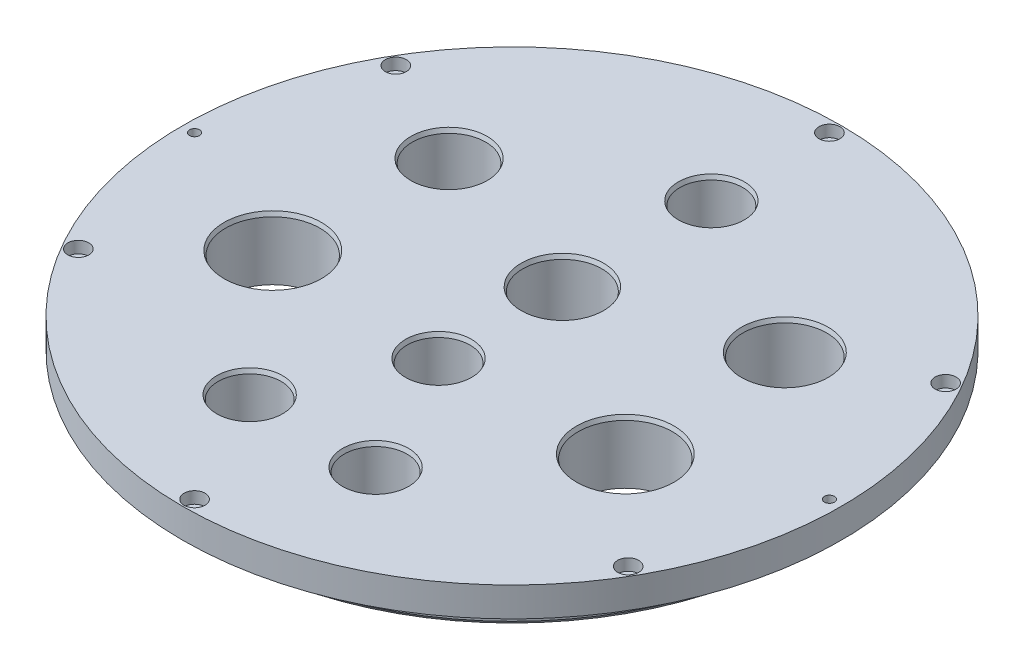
from build123d import *
from OCP.BRepFilletAPI import BRepFilletAPI_MakeChamfer

# Parameters (mm, degrees)
CHAMFER1_SIZE         = 0.762
CHAMFER1_SIZE2        = 0.439940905
SKETCH2_R             = 1.8415
CUT_EXTRUDE1_DEPTH    = 143.306777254
CIRPATTERN1_COUNT     = 6
SKETCH3_R             = 3.175
CUT_EXTRUDE2_DEPTH    = 3.556
SKETCH4_R             = 1.524
CUT_EXTRUDE3_DEPTH    = 143.306777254
SKETCH5_R             = 14.2875
SKETCH5_R_2           = 12.7
SKETCH5_R_3           = 11.1125
SKETCH5_R_4           = 9.525
SKETCH5_R_5           = 12
CONNECTOR_HOLES_DEPTH = 143.306777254
CHAMFER2_SIZE         = 1.27
CHAMFER2_SIZE2        = 0.462242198


with BuildPart() as part:
    # Sketch1 → Revolve1 (revolve)
    with BuildSketch(Plane.XY, mode=Mode.PRIVATE) as revolve1_sk:
        Polygon((0, 0), (87.3125, 0), (87.3125, 2.3622), (84.4931, 2.3622), (84.4931, 7.1628), (87.3125, 7.1628), (87.3125, 10.16), (88.7349, 10.16), (88.7349, 12.1158), (92.2655, 12.1158), (92.2655, 10.16), (99.7204, 10.16), (99.7204, 19.05), (0, 19.05), align=None)
    revolve(revolve1_sk.sketch.rotate(Axis((0, 0, 0), (0, 1, 0)), 90), axis=Axis((0, 0, 0), (0, 1, 0)))

    # Chamfer1
    chamfer1_edges = [part.edges().sort_by_distance(p)[0] for p in [
        (0, 0, 87.3125),
    ]]
    chamfer1_side = [part.faces().sort_by_distance(p)[0] for p in [
        (0, 1.1811, 87.3125),
    ]]
    chamfer(chamfer1_edges, length=CHAMFER1_SIZE, length2=CHAMFER1_SIZE2, reference=chamfer1_side[0])

    # Sketch2 → Cut-Extrude1 (cut, through all)
    with BuildSketch(Plane(origin=(0, 19.05, 0), x_dir=(1, 0, 0), z_dir=(0, 1, 0))):
        with Locations(Location((0, 96.0501, 0), (0, 0, 270))):
            Circle(SKETCH2_R)
    cut_extrude1 = extrude(amount=-CUT_EXTRUDE1_DEPTH, mode=Mode.SUBTRACT)

    # CirPattern1: Cut-Extrude1 ×6 about axis
    cirpattern1_axis = Axis((0, 0, 0), (0, 1, 0))
    for i in range(1, CIRPATTERN1_COUNT):
        add(cut_extrude1.rotate(cirpattern1_axis, i * 360 / CIRPATTERN1_COUNT), mode=Mode.SUBTRACT)

    # Sketch3 → Cut-Extrude2 (cut)
    with BuildSketch(Plane(origin=(0, 19.05, 0), x_dir=(1, 0, 0), z_dir=(0, 1, 0))):
        with Locations(Location((0, 96.0501, 0), (0, 0, 270))):
            Circle(SKETCH3_R)
        with Locations(Location((-83.181826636, 48.02505, 0), (0, 0, 270))):
            Circle(SKETCH3_R)
        with Locations(Location((-83.181826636, -48.02505, 0), (0, 0, 270))):
            Circle(SKETCH3_R)
        with Locations(Location((0, -96.0501, 0), (0, 0, 270))):
            Circle(SKETCH3_R)
        with Locations(Location((83.181826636, -48.02505, 0), (0, 0, 270))):
            Circle(SKETCH3_R)
        with Locations(Location((83.181826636, 48.02505, 0), (0, 0, 270))):
            Circle(SKETCH3_R)
    extrude(amount=-CUT_EXTRUDE2_DEPTH, mode=Mode.SUBTRACT)

    # Sketch4 → Cut-Extrude3 (cut, through all)
    with BuildSketch(Plane(origin=(0, 19.05, 0), x_dir=(1, 0, 0), z_dir=(0, 1, 0))):
        with Locations(Location((96.0501, 0, 0), (0, 0, 270))):
            Circle(SKETCH4_R)
        with Locations(Location((-96.0501, 0, 0), (0, 0, 270))):
            Circle(SKETCH4_R)
    extrude(amount=-CUT_EXTRUDE3_DEPTH, mode=Mode.SUBTRACT)

    # Sketch5 → connector holes (cut, through all)
    with BuildSketch(Plane(origin=(0, 19.05, 0), x_dir=(1, 0, 0), z_dir=(0, 1, 0))):
        with Locations(Location((-53.34, -19.05, 0), (0, 0, 270))):
            Circle(SKETCH5_R)
        with Locations(Location((53.34, -19.05, 0), (0, 0, 270))):
            Circle(SKETCH5_R)
        with Locations(Location((50.8, 31.75, 0), (0, 0, 270))):
            Circle(SKETCH5_R_2)
        with Locations(Location((-50.8, 31.75, 0), (0, 0, 270))):
            Circle(SKETCH5_R_3)
        with Locations(Location((19.05, -60.325, 0), (0, 0, 270))):
            Circle(SKETCH5_R_4)
        with Locations(Location((-19.05, -60.325, 0), (0, 0, 270))):
            Circle(SKETCH5_R_4)
        with Locations(Location((0, 15.24, 0), (0, 0, 270))):
            Circle(SKETCH5_R_5)
        with Locations(Location((0, -22.225, 0), (0, 0, 270))):
            Circle(SKETCH5_R_4)
        with Locations(Location((0, 60.325, 0), (0, 0, 270))):
            Circle(SKETCH5_R_4)
    extrude(amount=-CONNECTOR_HOLES_DEPTH, mode=Mode.SUBTRACT)

    # Chamfer2: one chamfer whose edges measure the first distance from different faces: ONE call of the kernel's chamfer builder (chamfer() names one face for all edges)
    chamfer2_edges_1 = [part.edges().sort_by_distance(p)[0] for p in [
        (-53.34, 19.05, 4.7625),
    ]]
    chamfer2_side_1 = [part.faces().sort_by_distance(p)[0] for p in [
        (-53.34, 9.525, 4.7625),
    ]]
    chamfer2_edges_2 = [part.edges().sort_by_distance(p)[0] for p in [
        (53.34, 19.05, 4.7625),
    ]]
    chamfer2_side_2 = [part.faces().sort_by_distance(p)[0] for p in [
        (53.34, 9.525, 4.7625),
    ]]
    chamfer2_edges_3 = [part.edges().sort_by_distance(p)[0] for p in [
        (50.8, 19.05, -44.45),
    ]]
    chamfer2_side_3 = [part.faces().sort_by_distance(p)[0] for p in [
        (50.8, 9.525, -44.45),
    ]]
    chamfer2_edges_4 = [part.edges().sort_by_distance(p)[0] for p in [
        (-50.8, 19.05, -42.8625),
    ]]
    chamfer2_side_4 = [part.faces().sort_by_distance(p)[0] for p in [
        (-50.8, 9.525, -42.8625),
    ]]
    chamfer2_edges_5 = [part.edges().sort_by_distance(p)[0] for p in [
        (19.05, 19.05, 50.8),
    ]]
    chamfer2_side_5 = [part.faces().sort_by_distance(p)[0] for p in [
        (19.05, 9.525, 50.8),
    ]]
    chamfer2_edges_6 = [part.edges().sort_by_distance(p)[0] for p in [
        (-19.05, 19.05, 50.8),
    ]]
    chamfer2_side_6 = [part.faces().sort_by_distance(p)[0] for p in [
        (-19.05, 9.525, 50.8),
    ]]
    chamfer2_edges_7 = [part.edges().sort_by_distance(p)[0] for p in [
        (0, 19.05, -27.24),
    ]]
    chamfer2_side_7 = [part.faces().sort_by_distance(p)[0] for p in [
        (0, 9.525, -27.24),
    ]]
    chamfer2_edges_8 = [part.edges().sort_by_distance(p)[0] for p in [
        (0, 19.05, 12.7),
    ]]
    chamfer2_side_8 = [part.faces().sort_by_distance(p)[0] for p in [
        (0, 9.525, 12.7),
    ]]
    chamfer2_edges_9 = [part.edges().sort_by_distance(p)[0] for p in [
        (0, 19.05, -69.85),
    ]]
    chamfer2_side_9 = [part.faces().sort_by_distance(p)[0] for p in [
        (0, 9.525, -69.85),
    ]]
    chamfer2 = BRepFilletAPI_MakeChamfer(part.part.solid().wrapped)
    for e in chamfer2_edges_1:
        chamfer2.Add(CHAMFER2_SIZE, CHAMFER2_SIZE2, e.wrapped, chamfer2_side_1[0].wrapped)  # the first distance lies on this face
    for e in chamfer2_edges_2:
        chamfer2.Add(CHAMFER2_SIZE, CHAMFER2_SIZE2, e.wrapped, chamfer2_side_2[0].wrapped)  # the first distance lies on this face
    for e in chamfer2_edges_3:
        chamfer2.Add(CHAMFER2_SIZE, CHAMFER2_SIZE2, e.wrapped, chamfer2_side_3[0].wrapped)  # the first distance lies on this face
    for e in chamfer2_edges_4:
        chamfer2.Add(CHAMFER2_SIZE, CHAMFER2_SIZE2, e.wrapped, chamfer2_side_4[0].wrapped)  # the first distance lies on this face
    for e in chamfer2_edges_5:
        chamfer2.Add(CHAMFER2_SIZE, CHAMFER2_SIZE2, e.wrapped, chamfer2_side_5[0].wrapped)  # the first distance lies on this face
    for e in chamfer2_edges_6:
        chamfer2.Add(CHAMFER2_SIZE, CHAMFER2_SIZE2, e.wrapped, chamfer2_side_6[0].wrapped)  # the first distance lies on this face
    for e in chamfer2_edges_7:
        chamfer2.Add(CHAMFER2_SIZE, CHAMFER2_SIZE2, e.wrapped, chamfer2_side_7[0].wrapped)  # the first distance lies on this face
    for e in chamfer2_edges_8:
        chamfer2.Add(CHAMFER2_SIZE, CHAMFER2_SIZE2, e.wrapped, chamfer2_side_8[0].wrapped)  # the first distance lies on this face
    for e in chamfer2_edges_9:
        chamfer2.Add(CHAMFER2_SIZE, CHAMFER2_SIZE2, e.wrapped, chamfer2_side_9[0].wrapped)  # the first distance lies on this face
    add(Compound.cast(chamfer2.Shape()), mode=Mode.REPLACE)


solid = part.part
